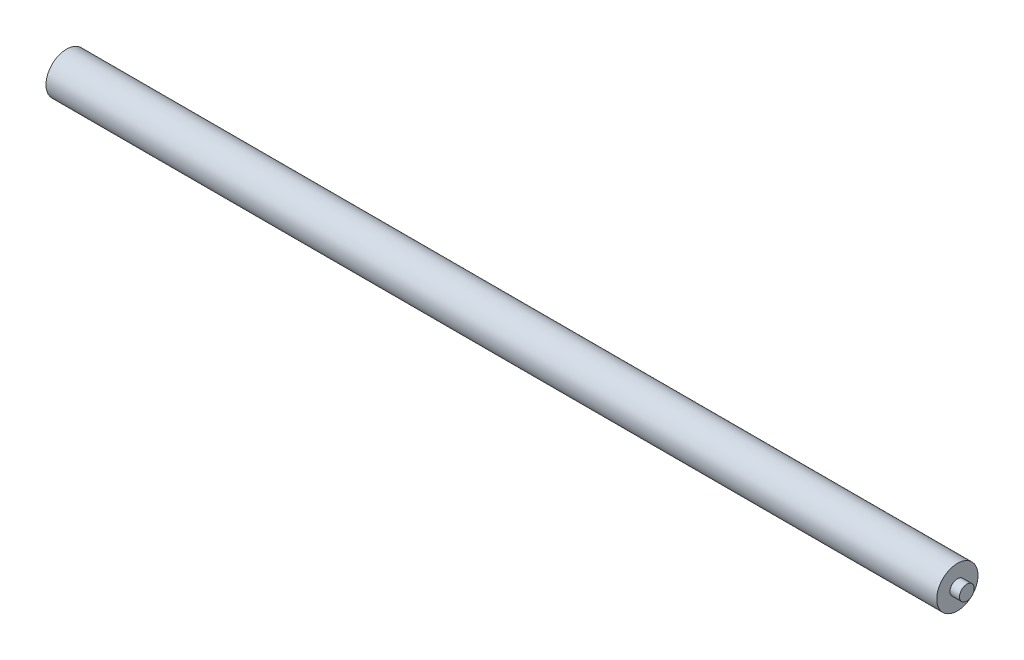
from build123d import *

# Parameters (mm, degrees)
SKETCH1_W           = 474.6625
SKETCH1_H           = 5.969
SKETCH2_R           = 3.937
BOSS_EXTRUDE1_DEPTH = 7.62
BOSS_EXTRUDE2_START = 2.54
SKETCH3_R           = 11.049
BOSS_EXTRUDE2_DEPTH = 2.54


with BuildPart() as part:
    # Sketch1 → Revolve1 (revolve)
    with BuildSketch(Plane.XY, mode=Mode.PRIVATE) as revolve1_sk:
        with Locations((-237.33125, 8.0645)):
            Rectangle(SKETCH1_W, SKETCH1_H)
    revolve(revolve1_sk.sketch.rotate(Axis((0, 0, 0), (-1, 0, 0)), 90), axis=Axis((0, 0, 0), (-1, 0, 0)))



with BuildPart() as body_2:
    # Sketch2 → Boss-Extrude1 (new body)
    with BuildSketch(Plane(origin=(0, 0, 0), x_dir=(0, 0, -1), z_dir=(1, 0, 0))):
        with Locations(Location((0, 0, 0), (0, 0, 180))):
            Circle(SKETCH2_R)
    extrude(amount=BOSS_EXTRUDE1_DEPTH)


with BuildPart() as part_1:
    add(part.part)

    add(body_2.part)  # Boss-Extrude2 merges body 2
    # Sketch3 → Boss-Extrude2 (add)
    with BuildSketch(Plane(origin=(0, 0, 0), x_dir=(0, 0, -1), z_dir=(1, 0, 0)).offset(BOSS_EXTRUDE2_START)):
        Circle(SKETCH3_R)
    extrude(amount=-BOSS_EXTRUDE2_DEPTH)


solid = part_1.part
